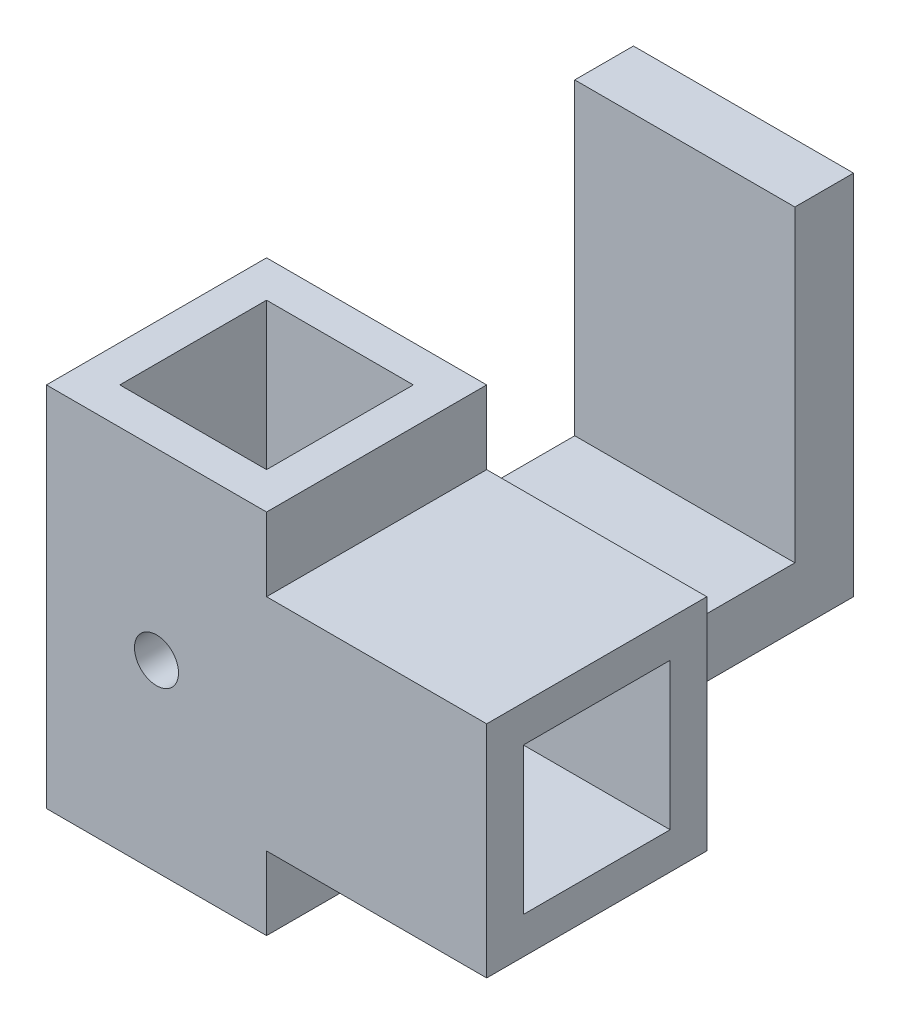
from build123d import *

# Parameters (mm, degrees)
SKETCH1_R                = 3
BOSS_EXTRUDE1_DEPTH      = 15
SKETCH2_W                = 20
SKETCH2_H                = 20
CUT_EXTRUDE1_DEPTH       = 59
SKETCH3_W                = 20
SKETCH3_H                = 20
CUT_EXTRUDE2_DEPTH       = 25
BOSS_EXTRUDE2_DEPTH      = 25
BOSS_EXTRUDE2_DEPTH_BACK = 5


with BuildPart() as part:
    # Sketch1 → Boss-Extrude1 (new, symmetric)
    with BuildSketch(Plane.XY):
        Polygon((15, 15), (15, 25), (-15, 25), (-15, -25), (15, -25), (15, -15), (45, -15), (45, 15), align=None)
        Circle(SKETCH1_R, mode=Mode.SUBTRACT)
    extrude(amount=BOSS_EXTRUDE1_DEPTH, both=True)

    # Sketch2 → Cut-Extrude1 (cut)
    with BuildSketch(Plane(origin=(0, 25, 0), x_dir=(1, 0, 0), z_dir=(0, 1, 0))):
        Rectangle(SKETCH2_W, SKETCH2_H)
    extrude(amount=-CUT_EXTRUDE1_DEPTH, mode=Mode.SUBTRACT)

    # Sketch3 → Cut-Extrude2 (cut)
    with BuildSketch(Plane(origin=(45, 0, 0), x_dir=(0, 0, -1), z_dir=(1, 0, 0))):
        Rectangle(SKETCH3_W, SKETCH3_H)
    extrude(amount=-CUT_EXTRUDE2_DEPTH, mode=Mode.SUBTRACT)

    # Sketch4 → Boss-Extrude2 (add, two sides: drawn at the far end of the back side and taken through both)
    with BuildSketch(Plane(origin=(-10, 0, 0), x_dir=(0, 0, -1), z_dir=(1, 0, 0)).offset(-BOSS_EXTRUDE2_DEPTH_BACK)):
        Polygon((15, -17), (57, -17), (57, 25), (65, 25), (65, -25), (15, -25), align=None)
    extrude(amount=BOSS_EXTRUDE2_DEPTH + BOSS_EXTRUDE2_DEPTH_BACK)


solid = part.part
